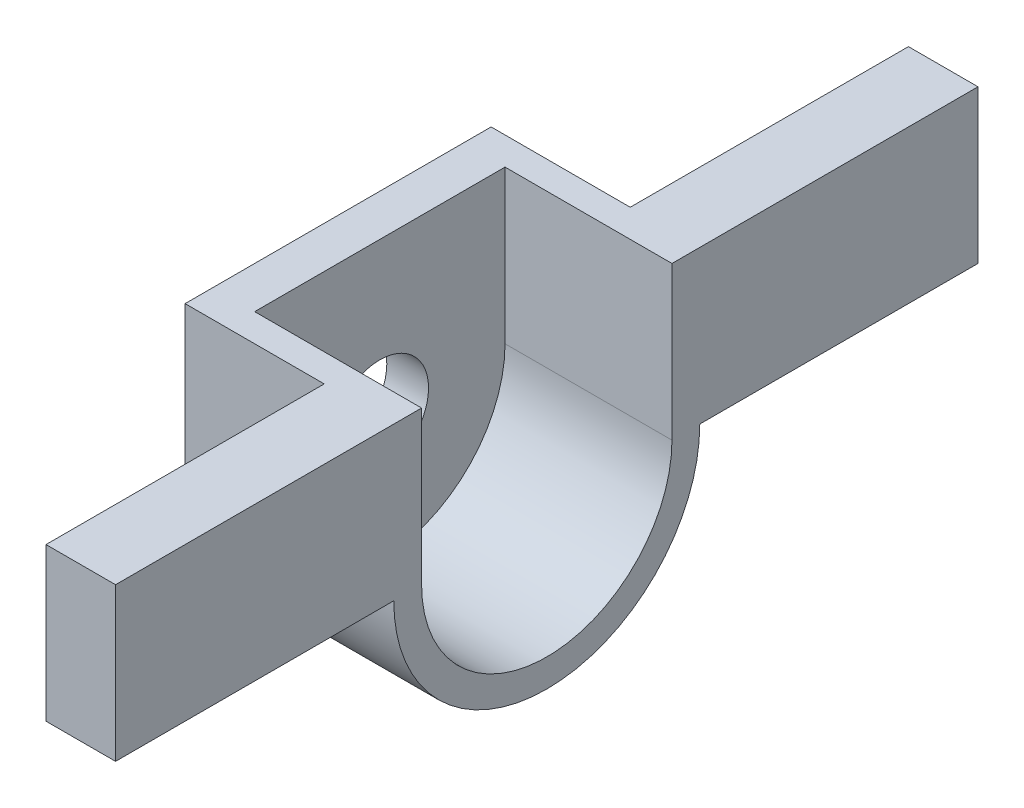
from build123d import *

# Parameters (mm, degrees)
BOSS_EXTRUDE2_DEPTH = 15
CUT_EXTRUDE1_DEPTH  = 12
SKETCH3_R           = 3.5
CUT_EXTRUDE2_DEPTH  = 20.646882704
SKETCH4_W           = 5
SKETCH4_H           = 11
BOSS_EXTRUDE3_DEPTH = 20
SKETCH5_W           = 5
SKETCH5_H           = 11
BOSS_EXTRUDE4_DEPTH = 20


with BuildPart() as part:
    # Sketch1 → Boss-Extrude2 (new body)
    with BuildSketch(Plane(origin=(0, 0, 0), x_dir=(0, 0, -1), z_dir=(1, 0, 0))):
        with BuildLine():
            Line((-11, 0), (-11, 11))
            Line((-11, 11), (11, 11))
            Line((11, 11), (11, 0))
            ThreePointArc((11, 0), (0, -11), (-11, 0))
        make_face()
    extrude(amount=BOSS_EXTRUDE2_DEPTH)

    # Sketch2 → Cut-Extrude1 (cut)
    with BuildSketch(Plane(origin=(15, 0, 0), x_dir=(0, 0, -1), z_dir=(1, 0, 0))):
        with BuildLine():
            Line((-9, 0), (-9, 11))
            Line((-9, 11), (9, 11))
            Line((9, 11), (9, 0))
            ThreePointArc((9, 0), (0, -9), (-9, 0))
        make_face()
    extrude(amount=-CUT_EXTRUDE1_DEPTH, mode=Mode.SUBTRACT)

    # Sketch3 → Cut-Extrude2 (cut, through all)
    with BuildSketch(Plane(origin=(3, 0, 0), x_dir=(0, 0, -1), z_dir=(1, 0, 0))):
        Circle(SKETCH3_R)
    extrude(amount=-CUT_EXTRUDE2_DEPTH, mode=Mode.SUBTRACT)

    # Sketch4 → Boss-Extrude3 (add)
    with BuildSketch(Plane(origin=(0, 0, -11), x_dir=(-1, 0, 0), z_dir=(0, 0, -1))):
        with Locations((-12.5, 5.5)):
            Rectangle(SKETCH4_W, SKETCH4_H)
    extrude(amount=BOSS_EXTRUDE3_DEPTH)

    # Sketch5 → Boss-Extrude4 (add)
    with BuildSketch(Plane.XY.offset(11)):
        with Locations((12.5, 5.5)):
            Rectangle(SKETCH5_W, SKETCH5_H)
    extrude(amount=BOSS_EXTRUDE4_DEPTH)


solid = part.part
